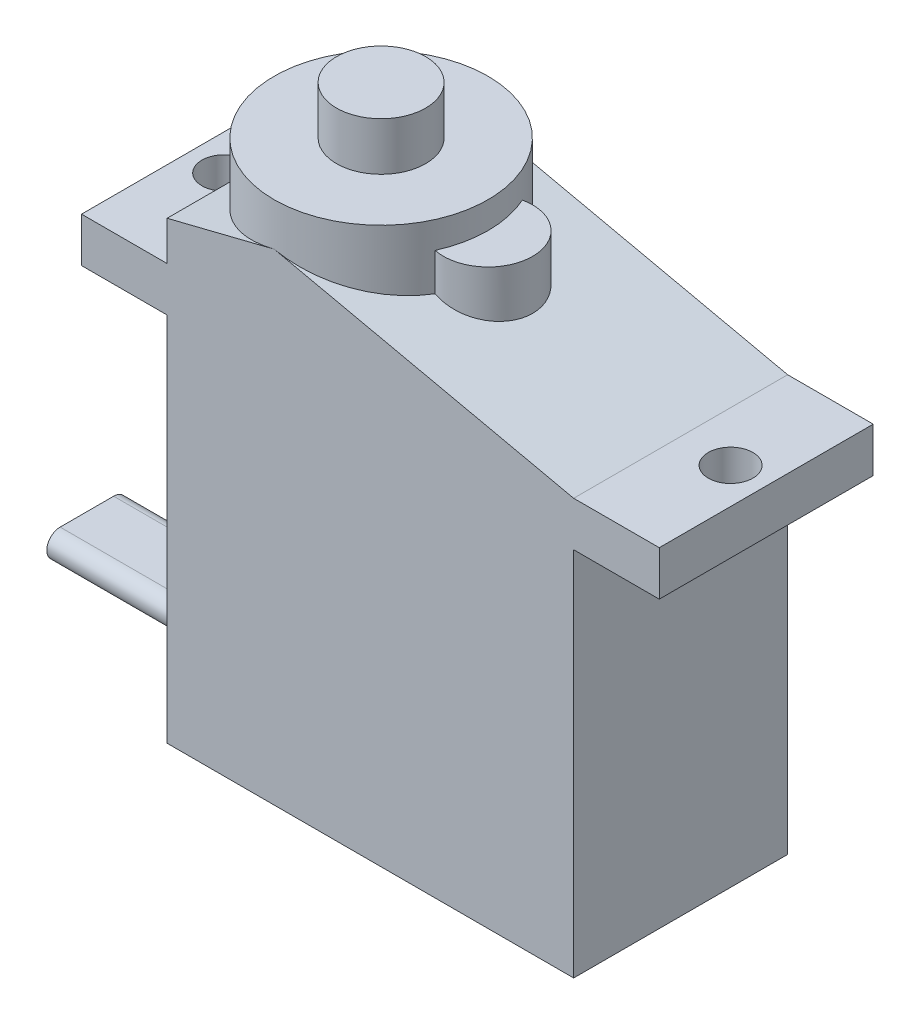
ISO-10303-21;
HEADER;
FILE_DESCRIPTION(('STEP AP214'),'2;1');
FILE_NAME('part.step','',(''),(''),'','','');
FILE_SCHEMA(('AUTOMOTIVE_DESIGN { 1 0 10303 214 1 1 1 1 }'));
ENDSEC;
DATA;
#1=APPLICATION_CONTEXT('core data for automotive mechanical design processes');
#2=APPLICATION_PROTOCOL_DEFINITION('international standard','automotive_design',2000,#1);
#3=PRODUCT_CONTEXT('',#1,'mechanical');
#4=PRODUCT('Part','Part','',(#3));
#5=PRODUCT_RELATED_PRODUCT_CATEGORY('part','',(#4));
#6=PRODUCT_DEFINITION_FORMATION('','',#4);
#7=PRODUCT_DEFINITION_CONTEXT('part definition',#1,'design');
#8=PRODUCT_DEFINITION('design','',#6,#7);
#9=PRODUCT_DEFINITION_SHAPE('','',#8);
#10=(LENGTH_UNIT() NAMED_UNIT(*) SI_UNIT(.MILLI.,.METRE.));
#11=(NAMED_UNIT(*) PLANE_ANGLE_UNIT() SI_UNIT($,.RADIAN.));
#12=(NAMED_UNIT(*) SI_UNIT($,.STERADIAN.) SOLID_ANGLE_UNIT());
#13=UNCERTAINTY_MEASURE_WITH_UNIT(LENGTH_MEASURE(1.E-05),#10,'distance_accuracy_value','');
#14=(GEOMETRIC_REPRESENTATION_CONTEXT(3) GLOBAL_UNCERTAINTY_ASSIGNED_CONTEXT((#13)) GLOBAL_UNIT_ASSIGNED_CONTEXT((#10,
#11,#12)) REPRESENTATION_CONTEXT('',''));
#15=CARTESIAN_POINT('',(0.,0.,0.));
#16=DIRECTION('',(0.,0.,1.));
#17=DIRECTION('',(1.,0.,0.));
#18=AXIS2_PLACEMENT_3D('',#15,#16,#17);
#19=CARTESIAN_POINT('',(6.,32.1,6.));
#20=DIRECTION('',(0.,-1.,0.));
#21=DIRECTION('',(0.,0.,-1.));
#22=AXIS2_PLACEMENT_3D('',#19,#20,#21);
#23=CYLINDRICAL_SURFACE('',#22,2.5);
#24=CARTESIAN_POINT('',(6.,32.1,6.));
#25=DIRECTION('',(0.,1.,0.));
#26=DIRECTION('',(0.,0.,1.));
#27=AXIS2_PLACEMENT_3D('',#24,#25,#26);
#28=CIRCLE('',#27,2.5);
#29=CARTESIAN_POINT('',(6.,32.1,3.5));
#30=VERTEX_POINT('',#29);
#31=EDGE_CURVE('E11',#30,#30,#28,.T.);
#32=CARTESIAN_POINT('',(6.,29.4,6.));
#33=DIRECTION('',(0.,1.,0.));
#34=DIRECTION('',(0.,0.,1.));
#35=AXIS2_PLACEMENT_3D('',#32,#33,#34);
#36=CIRCLE('',#35,2.5);
#37=CARTESIAN_POINT('',(6.,29.4,3.5));
#38=VERTEX_POINT('',#37);
#39=EDGE_CURVE('E53',#38,#38,#36,.T.);
#40=CARTESIAN_POINT('',(6.,32.1,3.5));
#41=CARTESIAN_POINT('',(6.,32.071875,3.5));
#42=CARTESIAN_POINT('',(6.,32.04375,3.5));
#43=CARTESIAN_POINT('',(6.,31.9875,3.5));
#44=CARTESIAN_POINT('',(6.,31.959375,3.5));
#45=CARTESIAN_POINT('',(6.,31.903125,3.5));
#46=CARTESIAN_POINT('',(6.,31.875,3.5));
#47=CARTESIAN_POINT('',(6.,31.81875,3.5));
#48=CARTESIAN_POINT('',(6.,31.790625,3.5));
#49=CARTESIAN_POINT('',(6.,31.734375,3.5));
#50=CARTESIAN_POINT('',(6.,31.70625,3.5));
#51=CARTESIAN_POINT('',(6.,31.65,3.5));
#52=CARTESIAN_POINT('',(6.,31.621875,3.5));
#53=CARTESIAN_POINT('',(6.,31.565625,3.5));
#54=CARTESIAN_POINT('',(6.,31.5375,3.5));
#55=CARTESIAN_POINT('',(6.,31.48125,3.5));
#56=CARTESIAN_POINT('',(6.,31.453125,3.5));
#57=CARTESIAN_POINT('',(6.,31.396875,3.5));
#58=CARTESIAN_POINT('',(6.,31.36875,3.5));
#59=CARTESIAN_POINT('',(6.,31.3125,3.5));
#60=CARTESIAN_POINT('',(6.,31.284375,3.5));
#61=CARTESIAN_POINT('',(6.,31.228125,3.5));
#62=CARTESIAN_POINT('',(6.,31.2,3.5));
#63=CARTESIAN_POINT('',(6.,31.14375,3.5));
#64=CARTESIAN_POINT('',(6.,31.115625,3.5));
#65=CARTESIAN_POINT('',(6.,31.059375,3.5));
#66=CARTESIAN_POINT('',(6.,31.03125,3.5));
#67=CARTESIAN_POINT('',(6.,30.975,3.5));
#68=CARTESIAN_POINT('',(6.,30.946875,3.5));
#69=CARTESIAN_POINT('',(6.,30.890625,3.5));
#70=CARTESIAN_POINT('',(6.,30.8625,3.5));
#71=CARTESIAN_POINT('',(6.,30.80625,3.5));
#72=CARTESIAN_POINT('',(6.,30.778125,3.5));
#73=CARTESIAN_POINT('',(6.,30.721875,3.5));
#74=CARTESIAN_POINT('',(6.,30.69375,3.5));
#75=CARTESIAN_POINT('',(6.,30.6375,3.5));
#76=CARTESIAN_POINT('',(6.,30.609375,3.5));
#77=CARTESIAN_POINT('',(6.,30.553125,3.5));
#78=CARTESIAN_POINT('',(6.,30.525,3.5));
#79=CARTESIAN_POINT('',(6.,30.46875,3.5));
#80=CARTESIAN_POINT('',(6.,30.440625,3.5));
#81=CARTESIAN_POINT('',(6.,30.384375,3.5));
#82=CARTESIAN_POINT('',(6.,30.35625,3.5));
#83=CARTESIAN_POINT('',(6.,30.3,3.5));
#84=CARTESIAN_POINT('',(6.,30.271875,3.5));
#85=CARTESIAN_POINT('',(6.,30.215625,3.5));
#86=CARTESIAN_POINT('',(6.,30.1875,3.5));
#87=CARTESIAN_POINT('',(6.,30.13125,3.5));
#88=CARTESIAN_POINT('',(6.,30.103125,3.5));
#89=CARTESIAN_POINT('',(6.,30.046875,3.5));
#90=CARTESIAN_POINT('',(6.,30.01875,3.5));
#91=CARTESIAN_POINT('',(6.,29.9625,3.5));
#92=CARTESIAN_POINT('',(6.,29.934375,3.5));
#93=CARTESIAN_POINT('',(6.,29.878125,3.5));
#94=CARTESIAN_POINT('',(6.,29.85,3.5));
#95=CARTESIAN_POINT('',(6.,29.79375,3.5));
#96=CARTESIAN_POINT('',(6.,29.765625,3.5));
#97=CARTESIAN_POINT('',(6.,29.709375,3.5));
#98=CARTESIAN_POINT('',(6.,29.68125,3.5));
#99=CARTESIAN_POINT('',(6.,29.625,3.5));
#100=CARTESIAN_POINT('',(6.,29.596875,3.5));
#101=CARTESIAN_POINT('',(6.,29.540625,3.5));
#102=CARTESIAN_POINT('',(6.,29.5125,3.5));
#103=CARTESIAN_POINT('',(6.,29.45625,3.5));
#104=CARTESIAN_POINT('',(6.,29.428125,3.5));
#105=CARTESIAN_POINT('',(6.,29.4,3.5));
#106=B_SPLINE_CURVE_WITH_KNOTS('',3,(#40,#41,#42,#43,#44,#45,#46,#47,#48,#49,#50,#51,#52,#53,
#54,#55,#56,#57,#58,#59,#60,#61,#62,#63,#64,#65,#66,#67,#68,#69,#70,#71,#72,#73,#74,#75,#76,#77,
#78,#79,#80,#81,#82,#83,#84,#85,#86,#87,#88,#89,#90,#91,#92,#93,#94,#95,#96,#97,#98,#99,#100,
#101,#102,#103,#104,#105),.UNSPECIFIED.,.F.,.F.,(4,2,2,2,2,2,2,2,2,2,2,2,2,2,2,2,2,2,2,2,2,2,2,
2,2,2,2,2,2,2,2,2,4),(0.,0.0843750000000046,0.168750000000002,0.253125,0.337500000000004,
0.421875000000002,0.50625,0.590625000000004,0.675000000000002,0.759375,0.843750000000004,
0.928125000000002,1.0125,1.096875,1.18125,1.265625,1.35,1.434375,1.51875,1.603125,1.6875,
1.771875,1.85625,1.940625,2.025,2.109375,2.19375,2.278125,2.3625,2.446875,2.53125,2.615625,2.7),.UNSPECIFIED.);
#107=EDGE_CURVE('BSEAM50',#30,#38,#106,.T.);
#108=ORIENTED_EDGE('',*,*,#31,.F.);
#109=ORIENTED_EDGE('',*,*,#39,.T.);
#110=ORIENTED_EDGE('',*,*,#107,.T.);
#111=ORIENTED_EDGE('',*,*,#107,.F.);
#112=EDGE_LOOP('',(#108,#110,#109,#111));
#113=FACE_BOUND('',#112,.T.);
#114=ADVANCED_FACE('F50',(#113),#23,.T.);
#115=CARTESIAN_POINT('',(6.,32.1,6.));
#116=DIRECTION('',(0.,1.,0.));
#117=DIRECTION('',(0.,0.,1.));
#118=AXIS2_PLACEMENT_3D('',#115,#116,#117);
#119=PLANE('',#118);
#120=ORIENTED_EDGE('',*,*,#31,.T.);
#121=EDGE_LOOP('',(#120));
#122=FACE_BOUND('',#121,.T.);
#123=ADVANCED_FACE('F65',(#122),#119,.T.);
#124=CARTESIAN_POINT('',(6.,29.4,6.));
#125=DIRECTION('',(0.,1.,0.));
#126=DIRECTION('',(0.,0.,1.));
#127=AXIS2_PLACEMENT_3D('',#124,#125,#126);
#128=PLANE('',#127);
#129=ORIENTED_EDGE('',*,*,#39,.F.);
#130=EDGE_LOOP('',(#129));
#131=FACE_BOUND('',#130,.T.);
#132=ADVANCED_FACE('F63',(#131),#128,.F.);
#133=CLOSED_SHELL('',(#114,#123,#132));
#134=MANIFOLD_SOLID_BREP('B2',#133);
#135=CARTESIAN_POINT('',(6.,27.,12.));
#136=DIRECTION('',(-0.215083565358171,-0.976595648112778,0.));
#137=DIRECTION('',(0.976595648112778,-0.215083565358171,0.));
#138=AXIS2_PLACEMENT_3D('',#135,#136,#137);
#139=PLANE('',#138);
#140=CARTESIAN_POINT('',(6.,26.9999999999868,6.));
#141=DIRECTION('',(-0.215083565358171,-0.976595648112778,0.));
#142=DIRECTION('',(-0.976595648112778,0.215083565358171,0.));
#143=AXIS2_PLACEMENT_3D('',#140,#141,#142);
#144=ELLIPSE('',#143,6.14379145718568,6.);
#145=CARTESIAN_POINT('',(6.,27.,0.));
#146=VERTEX_POINT('',#145);
#147=CARTESIAN_POINT('',(11.4791666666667,25.7932787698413,3.55485529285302));
#148=VERTEX_POINT('',#147);
#149=EDGE_CURVE('E258',#146,#148,#144,.T.);
#150=ORIENTED_EDGE('',*,*,#149,.T.);
#151=CARTESIAN_POINT('',(12.,25.6785714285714,6.));
#152=DIRECTION('',(-0.215083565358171,-0.976595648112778,0.));
#153=DIRECTION('',(-0.976595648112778,0.215083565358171,0.));
#154=AXIS2_PLACEMENT_3D('',#151,#152,#153);
#155=ELLIPSE('',#154,2.5599131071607,2.5);
#156=CARTESIAN_POINT('',(11.4791666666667,25.7932787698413,8.44514470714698));
#157=VERTEX_POINT('',#156);
#158=EDGE_CURVE('E243',#157,#148,#155,.F.);
#159=ORIENTED_EDGE('',*,*,#158,.F.);
#160=CARTESIAN_POINT('',(6.,27.0000000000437,12.));
#161=VERTEX_POINT('',#160);
#162=EDGE_CURVE('E267',#157,#161,#144,.T.);
#163=ORIENTED_EDGE('',*,*,#162,.T.);
#164=DIRECTION('',(-0.976595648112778,0.215083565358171,0.));
#165=VECTOR('',#164,1.);
#166=CARTESIAN_POINT('',(6.,27.,12.));
#167=LINE('',#166,#165);
#168=CARTESIAN_POINT('',(22.8,23.3,12.));
#169=VERTEX_POINT('',#168);
#170=EDGE_CURVE('E358',#169,#161,#167,.T.);
#171=ORIENTED_EDGE('',*,*,#170,.F.);
#172=DIRECTION('',(0.,0.,-1.));
#173=VECTOR('',#172,1.);
#174=CARTESIAN_POINT('',(22.8,23.3,12.));
#175=LINE('',#174,#173);
#176=CARTESIAN_POINT('',(22.8,23.3,0.));
#177=VERTEX_POINT('',#176);
#178=EDGE_CURVE('E411',#169,#177,#175,.T.);
#179=ORIENTED_EDGE('',*,*,#178,.T.);
#180=DIRECTION('',(-0.976595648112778,0.215083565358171,0.));
#181=VECTOR('',#180,1.);
#182=CARTESIAN_POINT('',(6.,27.,0.));
#183=LINE('',#182,#181);
#184=EDGE_CURVE('E264',#177,#146,#183,.T.);
#185=ORIENTED_EDGE('',*,*,#184,.T.);
#186=EDGE_LOOP('',(#150,#159,#163,#171,#179,#185));
#187=FACE_BOUND('',#186,.T.);
#188=ADVANCED_FACE('F90',(#187),#139,.F.);
#189=CARTESIAN_POINT('',(0.,25.5,12.));
#190=DIRECTION('',(0.242535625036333,-0.970142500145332,0.));
#191=DIRECTION('',(0.970142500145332,0.242535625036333,0.));
#192=AXIS2_PLACEMENT_3D('',#189,#190,#191);
#193=PLANE('',#192);
#194=CARTESIAN_POINT('',(6.,27.0000000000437,6.));
#195=DIRECTION('',(0.242535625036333,-0.970142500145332,0.));
#196=DIRECTION('',(0.970142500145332,0.242535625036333,0.));
#197=AXIS2_PLACEMENT_3D('',#194,#195,#196);
#198=ELLIPSE('',#197,6.18465843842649,6.);
#199=CARTESIAN_POINT('',(0.,25.5,6.));
#200=VERTEX_POINT('',#199);
#201=EDGE_CURVE('E266',#200,#146,#198,.T.);
#202=ORIENTED_EDGE('',*,*,#201,.T.);
#203=DIRECTION('',(-0.970142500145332,-0.242535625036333,0.));
#204=VECTOR('',#203,1.);
#205=CARTESIAN_POINT('',(0.,25.5,0.));
#206=LINE('',#205,#204);
#207=CARTESIAN_POINT('',(0.,25.5,0.));
#208=VERTEX_POINT('',#207);
#209=EDGE_CURVE('E386',#146,#208,#206,.T.);
#210=ORIENTED_EDGE('',*,*,#209,.T.);
#211=DIRECTION('',(0.,0.,-1.));
#212=VECTOR('',#211,1.);
#213=CARTESIAN_POINT('',(0.,25.5,12.));
#214=LINE('',#213,#212);
#215=EDGE_CURVE('E407',#200,#208,#214,.T.);
#216=ORIENTED_EDGE('',*,*,#215,.F.);
#217=EDGE_LOOP('',(#202,#210,#216));
#218=FACE_BOUND('',#217,.T.);
#219=ADVANCED_FACE('F474',(#218),#193,.F.);
#220=EDGE_CURVE('E114',#161,#200,#198,.T.);
#221=ORIENTED_EDGE('',*,*,#220,.T.);
#222=CARTESIAN_POINT('',(0.,25.5,12.));
#223=VERTEX_POINT('',#222);
#224=EDGE_CURVE('E408',#223,#200,#214,.T.);
#225=ORIENTED_EDGE('',*,*,#224,.F.);
#226=DIRECTION('',(-0.970142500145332,-0.242535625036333,0.));
#227=VECTOR('',#226,1.);
#228=CARTESIAN_POINT('',(0.,25.5,12.));
#229=LINE('',#228,#227);
#230=EDGE_CURVE('E361',#161,#223,#229,.T.);
#231=ORIENTED_EDGE('',*,*,#230,.F.);
#232=EDGE_LOOP('',(#221,#225,#231));
#233=FACE_BOUND('',#232,.T.);
#234=ADVANCED_FACE('F476',(#233),#193,.F.);
#235=CARTESIAN_POINT('',(-0.5,2.25,4.5));
#236=DIRECTION('',(-1.,0.,0.));
#237=DIRECTION('',(0.,0.,1.));
#238=AXIS2_PLACEMENT_3D('',#235,#236,#237);
#239=PLANE('',#238);
#240=CARTESIAN_POINT('',(-0.5,2.25,4.5));
#241=DIRECTION('',(-1.,0.,0.));
#242=DIRECTION('',(0.,0.,1.));
#243=AXIS2_PLACEMENT_3D('',#240,#241,#242);
#244=CIRCLE('',#243,1.25);
#245=CARTESIAN_POINT('',(-0.5,3.5,4.5));
#246=VERTEX_POINT('',#245);
#247=CARTESIAN_POINT('',(-0.5,0.999999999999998,4.5));
#248=VERTEX_POINT('',#247);
#249=EDGE_CURVE('E303',#246,#248,#244,.T.);
#250=ORIENTED_EDGE('',*,*,#249,.T.);
#251=DIRECTION('',(0.,0.,1.));
#252=VECTOR('',#251,1.);
#253=CARTESIAN_POINT('',(-0.5,0.999999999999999,7.5));
#254=LINE('',#253,#252);
#255=CARTESIAN_POINT('',(-0.5,0.999999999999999,7.5));
#256=VERTEX_POINT('',#255);
#257=EDGE_CURVE('E306',#248,#256,#254,.T.);
#258=ORIENTED_EDGE('',*,*,#257,.T.);
#259=CARTESIAN_POINT('',(-0.5,2.25,7.5));
#260=DIRECTION('',(-1.,0.,0.));
#261=DIRECTION('',(0.,0.,-1.));
#262=AXIS2_PLACEMENT_3D('',#259,#260,#261);
#263=CIRCLE('',#262,1.25);
#264=CARTESIAN_POINT('',(-0.5,3.5,7.5));
#265=VERTEX_POINT('',#264);
#266=EDGE_CURVE('E309',#256,#265,#263,.T.);
#267=ORIENTED_EDGE('',*,*,#266,.T.);
#268=DIRECTION('',(0.,0.,-1.));
#269=VECTOR('',#268,1.);
#270=CARTESIAN_POINT('',(-0.5,3.5,4.5));
#271=LINE('',#270,#269);
#272=EDGE_CURVE('E311',#265,#246,#271,.T.);
#273=ORIENTED_EDGE('',*,*,#272,.T.);
#274=EDGE_LOOP('',(#250,#258,#267,#273));
#275=FACE_BOUND('',#274,.T.);
#276=DIRECTION('',(0.,0.,1.));
#277=VECTOR('',#276,1.);
#278=CARTESIAN_POINT('',(-0.5,1.5,4.5));
#279=LINE('',#278,#277);
#280=CARTESIAN_POINT('',(-0.5,1.5,4.5));
#281=VERTEX_POINT('',#280);
#282=CARTESIAN_POINT('',(-0.5,1.5,7.5));
#283=VERTEX_POINT('',#282);
#284=EDGE_CURVE('E287',#281,#283,#279,.T.);
#285=ORIENTED_EDGE('',*,*,#284,.F.);
#286=CARTESIAN_POINT('',(-0.5,2.25,4.5));
#287=DIRECTION('',(-1.,0.,0.));
#288=DIRECTION('',(0.,0.,1.));
#289=AXIS2_PLACEMENT_3D('',#286,#287,#288);
#290=CIRCLE('',#289,0.75);
#291=CARTESIAN_POINT('',(-0.5,3.,4.5));
#292=VERTEX_POINT('',#291);
#293=EDGE_CURVE('E284',#292,#281,#290,.T.);
#294=ORIENTED_EDGE('',*,*,#293,.F.);
#295=DIRECTION('',(0.,0.,-1.));
#296=VECTOR('',#295,1.);
#297=CARTESIAN_POINT('',(-0.5,3.,7.5));
#298=LINE('',#297,#296);
#299=CARTESIAN_POINT('',(-0.5,3.,7.5));
#300=VERTEX_POINT('',#299);
#301=EDGE_CURVE('E277',#300,#292,#298,.T.);
#302=ORIENTED_EDGE('',*,*,#301,.F.);
#303=CARTESIAN_POINT('',(-0.5,2.25,7.5));
#304=DIRECTION('',(-1.,0.,0.));
#305=DIRECTION('',(0.,0.,1.));
#306=AXIS2_PLACEMENT_3D('',#303,#304,#305);
#307=CIRCLE('',#306,0.75);
#308=EDGE_CURVE('E289',#283,#300,#307,.T.);
#309=ORIENTED_EDGE('',*,*,#308,.F.);
#310=EDGE_LOOP('',(#285,#294,#302,#309));
#311=FACE_BOUND('',#310,.T.);
#312=ADVANCED_FACE('F478',(#275,#311),#239,.T.);
#313=CARTESIAN_POINT('',(0.,0.,12.));
#314=DIRECTION('',(1.,0.,0.));
#315=DIRECTION('',(0.,0.,-1.));
#316=AXIS2_PLACEMENT_3D('',#313,#314,#315);
#317=PLANE('',#316);
#318=DIRECTION('',(0.,-1.,0.));
#319=VECTOR('',#318,1.);
#320=CARTESIAN_POINT('',(0.,0.,0.));
#321=LINE('',#320,#319);
#322=CARTESIAN_POINT('',(0.,20.8,0.));
#323=VERTEX_POINT('',#322);
#324=CARTESIAN_POINT('',(0.,0.,0.));
#325=VERTEX_POINT('',#324);
#326=EDGE_CURVE('E372',#323,#325,#321,.T.);
#327=ORIENTED_EDGE('',*,*,#326,.T.);
#328=DIRECTION('',(0.,0.,-1.));
#329=VECTOR('',#328,1.);
#330=CARTESIAN_POINT('',(0.,0.,12.));
#331=LINE('',#330,#329);
#332=CARTESIAN_POINT('',(0.,0.,12.));
#333=VERTEX_POINT('',#332);
#334=EDGE_CURVE('E48',#333,#325,#331,.T.);
#335=ORIENTED_EDGE('',*,*,#334,.F.);
#336=DIRECTION('',(0.,-1.,0.));
#337=VECTOR('',#336,1.);
#338=CARTESIAN_POINT('',(0.,0.,12.));
#339=LINE('',#338,#337);
#340=CARTESIAN_POINT('',(0.,20.8,12.));
#341=VERTEX_POINT('',#340);
#342=EDGE_CURVE('E344',#341,#333,#339,.T.);
#343=ORIENTED_EDGE('',*,*,#342,.F.);
#344=DIRECTION('',(0.,0.,-1.));
#345=VECTOR('',#344,1.);
#346=CARTESIAN_POINT('',(0.,20.8,12.));
#347=LINE('',#346,#345);
#348=EDGE_CURVE('E371',#341,#323,#347,.T.);
#349=ORIENTED_EDGE('',*,*,#348,.T.);
#350=EDGE_LOOP('',(#327,#335,#343,#349));
#351=FACE_BOUND('',#350,.T.);
#352=CARTESIAN_POINT('',(0.,2.25,4.5));
#353=DIRECTION('',(-1.,0.,0.));
#354=DIRECTION('',(0.,0.,1.));
#355=AXIS2_PLACEMENT_3D('',#352,#353,#354);
#356=CIRCLE('',#355,1.25);
#357=CARTESIAN_POINT('',(0.,3.5,4.5));
#358=VERTEX_POINT('',#357);
#359=CARTESIAN_POINT('',(0.,0.999999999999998,4.5));
#360=VERTEX_POINT('',#359);
#361=EDGE_CURVE('E302',#358,#360,#356,.T.);
#362=ORIENTED_EDGE('',*,*,#361,.F.);
#363=DIRECTION('',(0.,0.,-1.));
#364=VECTOR('',#363,1.);
#365=CARTESIAN_POINT('',(0.,3.5,4.5));
#366=LINE('',#365,#364);
#367=CARTESIAN_POINT('',(0.,3.5,7.5));
#368=VERTEX_POINT('',#367);
#369=EDGE_CURVE('E307',#368,#358,#366,.T.);
#370=ORIENTED_EDGE('',*,*,#369,.F.);
#371=CARTESIAN_POINT('',(0.,2.25,7.5));
#372=DIRECTION('',(-1.,0.,0.));
#373=DIRECTION('',(0.,0.,-1.));
#374=AXIS2_PLACEMENT_3D('',#371,#372,#373);
#375=CIRCLE('',#374,1.25);
#376=CARTESIAN_POINT('',(0.,0.999999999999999,7.5));
#377=VERTEX_POINT('',#376);
#378=EDGE_CURVE('E319',#377,#368,#375,.T.);
#379=ORIENTED_EDGE('',*,*,#378,.F.);
#380=DIRECTION('',(0.,0.,1.));
#381=VECTOR('',#380,1.);
#382=CARTESIAN_POINT('',(0.,0.999999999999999,7.5));
#383=LINE('',#382,#381);
#384=EDGE_CURVE('E316',#360,#377,#383,.T.);
#385=ORIENTED_EDGE('',*,*,#384,.F.);
#386=EDGE_LOOP('',(#362,#370,#379,#385));
#387=FACE_BOUND('',#386,.T.);
#388=ADVANCED_FACE('F92',(#351,#387),#317,.F.);
#389=CARTESIAN_POINT('',(0.,0.,12.));
#390=DIRECTION('',(0.,1.,0.));
#391=DIRECTION('',(0.,0.,1.));
#392=AXIS2_PLACEMENT_3D('',#389,#390,#391);
#393=PLANE('',#392);
#394=DIRECTION('',(1.,0.,0.));
#395=VECTOR('',#394,1.);
#396=CARTESIAN_POINT('',(0.,0.,0.));
#397=LINE('',#396,#395);
#398=CARTESIAN_POINT('',(22.8,0.,0.));
#399=VERTEX_POINT('',#398);
#400=EDGE_CURVE('E375',#325,#399,#397,.T.);
#401=ORIENTED_EDGE('',*,*,#400,.T.);
#402=DIRECTION('',(0.,0.,-1.));
#403=VECTOR('',#402,1.);
#404=CARTESIAN_POINT('',(22.8,0.,12.));
#405=LINE('',#404,#403);
#406=CARTESIAN_POINT('',(22.8,0.,12.));
#407=VERTEX_POINT('',#406);
#408=EDGE_CURVE('E99',#407,#399,#405,.T.);
#409=ORIENTED_EDGE('',*,*,#408,.F.);
#410=DIRECTION('',(1.,0.,0.));
#411=VECTOR('',#410,1.);
#412=CARTESIAN_POINT('',(0.,0.,12.));
#413=LINE('',#412,#411);
#414=EDGE_CURVE('E347',#333,#407,#413,.T.);
#415=ORIENTED_EDGE('',*,*,#414,.F.);
#416=ORIENTED_EDGE('',*,*,#334,.T.);
#417=EDGE_LOOP('',(#401,#409,#415,#416));
#418=FACE_BOUND('',#417,.T.);
#419=ADVANCED_FACE('F450',(#418),#393,.F.);
#420=CARTESIAN_POINT('',(22.8,0.,12.));
#421=DIRECTION('',(-1.,0.,0.));
#422=DIRECTION('',(0.,0.,1.));
#423=AXIS2_PLACEMENT_3D('',#420,#421,#422);
#424=PLANE('',#423);
#425=DIRECTION('',(0.,1.,0.));
#426=VECTOR('',#425,1.);
#427=CARTESIAN_POINT('',(22.8,0.,0.));
#428=LINE('',#427,#426);
#429=CARTESIAN_POINT('',(22.8,20.8,0.));
#430=VERTEX_POINT('',#429);
#431=EDGE_CURVE('E377',#399,#430,#428,.T.);
#432=ORIENTED_EDGE('',*,*,#431,.T.);
#433=DIRECTION('',(0.,0.,-1.));
#434=VECTOR('',#433,1.);
#435=CARTESIAN_POINT('',(22.8,20.8,12.));
#436=LINE('',#435,#434);
#437=CARTESIAN_POINT('',(22.8,20.8,12.));
#438=VERTEX_POINT('',#437);
#439=EDGE_CURVE('E419',#438,#430,#436,.T.);
#440=ORIENTED_EDGE('',*,*,#439,.F.);
#441=DIRECTION('',(0.,1.,0.));
#442=VECTOR('',#441,1.);
#443=CARTESIAN_POINT('',(22.8,0.,12.));
#444=LINE('',#443,#442);
#445=EDGE_CURVE('E350',#407,#438,#444,.T.);
#446=ORIENTED_EDGE('',*,*,#445,.F.);
#447=ORIENTED_EDGE('',*,*,#408,.T.);
#448=EDGE_LOOP('',(#432,#440,#446,#447));
#449=FACE_BOUND('',#448,.T.);
#450=ADVANCED_FACE('F427',(#449),#424,.F.);
#451=CARTESIAN_POINT('',(22.8,20.8,12.));
#452=DIRECTION('',(0.,1.,0.));
#453=DIRECTION('',(0.,0.,1.));
#454=AXIS2_PLACEMENT_3D('',#451,#452,#453);
#455=PLANE('',#454);
#456=CARTESIAN_POINT('',(25.6,20.8,6.));
#457=DIRECTION('',(0.,1.,0.));
#458=DIRECTION('',(0.,0.,1.));
#459=AXIS2_PLACEMENT_3D('',#456,#457,#458);
#460=CIRCLE('',#459,1.25);
#461=CARTESIAN_POINT('',(25.6,20.8,7.25));
#462=VERTEX_POINT('',#461);
#463=EDGE_CURVE('E338',#462,#462,#460,.T.);
#464=ORIENTED_EDGE('',*,*,#463,.T.);
#465=EDGE_LOOP('',(#464));
#466=FACE_BOUND('',#465,.T.);
#467=DIRECTION('',(1.,0.,0.));
#468=VECTOR('',#467,1.);
#469=CARTESIAN_POINT('',(22.8,20.8,0.));
#470=LINE('',#469,#468);
#471=CARTESIAN_POINT('',(27.6,20.8,0.));
#472=VERTEX_POINT('',#471);
#473=EDGE_CURVE('E379',#430,#472,#470,.T.);
#474=ORIENTED_EDGE('',*,*,#473,.T.);
#475=DIRECTION('',(0.,0.,-1.));
#476=VECTOR('',#475,1.);
#477=CARTESIAN_POINT('',(27.6,20.8,12.));
#478=LINE('',#477,#476);
#479=CARTESIAN_POINT('',(27.6,20.8,12.));
#480=VERTEX_POINT('',#479);
#481=EDGE_CURVE('E416',#480,#472,#478,.T.);
#482=ORIENTED_EDGE('',*,*,#481,.F.);
#483=DIRECTION('',(1.,0.,0.));
#484=VECTOR('',#483,1.);
#485=CARTESIAN_POINT('',(22.8,20.8,12.));
#486=LINE('',#485,#484);
#487=EDGE_CURVE('E352',#438,#480,#486,.T.);
#488=ORIENTED_EDGE('',*,*,#487,.F.);
#489=ORIENTED_EDGE('',*,*,#439,.T.);
#490=EDGE_LOOP('',(#474,#482,#488,#489));
#491=FACE_BOUND('',#490,.T.);
#492=ADVANCED_FACE('F438',(#466,#491),#455,.F.);
#493=CARTESIAN_POINT('',(27.6,20.8,12.));
#494=DIRECTION('',(-1.,0.,0.));
#495=DIRECTION('',(0.,0.,1.));
#496=AXIS2_PLACEMENT_3D('',#493,#494,#495);
#497=PLANE('',#496);
#498=DIRECTION('',(0.,1.,0.));
#499=VECTOR('',#498,1.);
#500=CARTESIAN_POINT('',(27.6,20.8,0.));
#501=LINE('',#500,#499);
#502=CARTESIAN_POINT('',(27.6,23.3,0.));
#503=VERTEX_POINT('',#502);
#504=EDGE_CURVE('E381',#472,#503,#501,.T.);
#505=ORIENTED_EDGE('',*,*,#504,.T.);
#506=DIRECTION('',(0.,0.,-1.));
#507=VECTOR('',#506,1.);
#508=CARTESIAN_POINT('',(27.6,23.3,12.));
#509=LINE('',#508,#507);
#510=CARTESIAN_POINT('',(27.6,23.3,12.));
#511=VERTEX_POINT('',#510);
#512=EDGE_CURVE('E413',#511,#503,#509,.T.);
#513=ORIENTED_EDGE('',*,*,#512,.F.);
#514=DIRECTION('',(0.,1.,0.));
#515=VECTOR('',#514,1.);
#516=CARTESIAN_POINT('',(27.6,20.8,12.));
#517=LINE('',#516,#515);
#518=EDGE_CURVE('E354',#480,#511,#517,.T.);
#519=ORIENTED_EDGE('',*,*,#518,.F.);
#520=ORIENTED_EDGE('',*,*,#481,.T.);
#521=EDGE_LOOP('',(#505,#513,#519,#520));
#522=FACE_BOUND('',#521,.T.);
#523=ADVANCED_FACE('F442',(#522),#497,.F.);
#524=CARTESIAN_POINT('',(27.6,23.3,12.));
#525=DIRECTION('',(0.,-1.,0.));
#526=DIRECTION('',(0.,0.,-1.));
#527=AXIS2_PLACEMENT_3D('',#524,#525,#526);
#528=PLANE('',#527);
#529=CARTESIAN_POINT('',(25.6,23.3,6.));
#530=DIRECTION('',(0.,1.,0.));
#531=DIRECTION('',(0.,0.,1.));
#532=AXIS2_PLACEMENT_3D('',#529,#530,#531);
#533=CIRCLE('',#532,1.25);
#534=CARTESIAN_POINT('',(25.6,23.3,7.25));
#535=VERTEX_POINT('',#534);
#536=EDGE_CURVE('E335',#535,#535,#533,.T.);
#537=ORIENTED_EDGE('',*,*,#536,.F.);
#538=EDGE_LOOP('',(#537));
#539=FACE_BOUND('',#538,.T.);
#540=DIRECTION('',(-1.,0.,0.));
#541=VECTOR('',#540,1.);
#542=CARTESIAN_POINT('',(27.6,23.3,0.));
#543=LINE('',#542,#541);
#544=EDGE_CURVE('E383',#503,#177,#543,.T.);
#545=ORIENTED_EDGE('',*,*,#544,.T.);
#546=ORIENTED_EDGE('',*,*,#178,.F.);
#547=DIRECTION('',(-1.,0.,0.));
#548=VECTOR('',#547,1.);
#549=CARTESIAN_POINT('',(27.6,23.3,12.));
#550=LINE('',#549,#548);
#551=EDGE_CURVE('E356',#511,#169,#550,.T.);
#552=ORIENTED_EDGE('',*,*,#551,.F.);
#553=ORIENTED_EDGE('',*,*,#512,.T.);
#554=EDGE_LOOP('',(#545,#546,#552,#553));
#555=FACE_BOUND('',#554,.T.);
#556=ADVANCED_FACE('F492',(#539,#555),#528,.F.);
#557=CARTESIAN_POINT('',(0.,23.3,12.));
#558=DIRECTION('',(1.,0.,0.));
#559=DIRECTION('',(0.,1.,0.));
#560=AXIS2_PLACEMENT_3D('',#557,#558,#559);
#561=PLANE('',#560);
#562=DIRECTION('',(0.,-1.,0.));
#563=VECTOR('',#562,1.);
#564=CARTESIAN_POINT('',(0.,23.3,0.));
#565=LINE('',#564,#563);
#566=CARTESIAN_POINT('',(0.,23.3,0.));
#567=VERTEX_POINT('',#566);
#568=EDGE_CURVE('E389',#208,#567,#565,.T.);
#569=ORIENTED_EDGE('',*,*,#568,.T.);
#570=DIRECTION('',(0.,0.,-1.));
#571=VECTOR('',#570,1.);
#572=CARTESIAN_POINT('',(0.,23.3,12.));
#573=LINE('',#572,#571);
#574=CARTESIAN_POINT('',(0.,23.3,12.));
#575=VERTEX_POINT('',#574);
#576=EDGE_CURVE('E404',#575,#567,#573,.T.);
#577=ORIENTED_EDGE('',*,*,#576,.F.);
#578=DIRECTION('',(0.,-1.,0.));
#579=VECTOR('',#578,1.);
#580=CARTESIAN_POINT('',(0.,23.3,12.));
#581=LINE('',#580,#579);
#582=EDGE_CURVE('E363',#223,#575,#581,.T.);
#583=ORIENTED_EDGE('',*,*,#582,.F.);
#584=ORIENTED_EDGE('',*,*,#224,.T.);
#585=ORIENTED_EDGE('',*,*,#215,.T.);
#586=EDGE_LOOP('',(#569,#577,#583,#584,#585));
#587=FACE_BOUND('',#586,.T.);
#588=ADVANCED_FACE('F471',(#587),#561,.F.);
#589=CARTESIAN_POINT('',(0.,23.3,12.));
#590=DIRECTION('',(0.,-1.,0.));
#591=DIRECTION('',(0.,0.,-1.));
#592=AXIS2_PLACEMENT_3D('',#589,#590,#591);
#593=PLANE('',#592);
#594=CARTESIAN_POINT('',(-2.8,23.3,6.));
#595=DIRECTION('',(0.,1.,0.));
#596=DIRECTION('',(0.,0.,1.));
#597=AXIS2_PLACEMENT_3D('',#594,#595,#596);
#598=CIRCLE('',#597,1.25);
#599=CARTESIAN_POINT('',(-2.8,23.3,7.25));
#600=VERTEX_POINT('',#599);
#601=EDGE_CURVE('E341',#600,#600,#598,.T.);
#602=ORIENTED_EDGE('',*,*,#601,.F.);
#603=EDGE_LOOP('',(#602));
#604=FACE_BOUND('',#603,.T.);
#605=DIRECTION('',(-1.,0.,0.));
#606=VECTOR('',#605,1.);
#607=CARTESIAN_POINT('',(0.,23.3,0.));
#608=LINE('',#607,#606);
#609=CARTESIAN_POINT('',(-4.8,23.3,0.));
#610=VERTEX_POINT('',#609);
#611=EDGE_CURVE('E391',#567,#610,#608,.T.);
#612=ORIENTED_EDGE('',*,*,#611,.T.);
#613=DIRECTION('',(0.,0.,-1.));
#614=VECTOR('',#613,1.);
#615=CARTESIAN_POINT('',(-4.8,23.3,12.));
#616=LINE('',#615,#614);
#617=CARTESIAN_POINT('',(-4.8,23.3,12.));
#618=VERTEX_POINT('',#617);
#619=EDGE_CURVE('E401',#618,#610,#616,.T.);
#620=ORIENTED_EDGE('',*,*,#619,.F.);
#621=DIRECTION('',(-1.,0.,0.));
#622=VECTOR('',#621,1.);
#623=CARTESIAN_POINT('',(0.,23.3,12.));
#624=LINE('',#623,#622);
#625=EDGE_CURVE('E365',#575,#618,#624,.T.);
#626=ORIENTED_EDGE('',*,*,#625,.F.);
#627=ORIENTED_EDGE('',*,*,#576,.T.);
#628=EDGE_LOOP('',(#612,#620,#626,#627));
#629=FACE_BOUND('',#628,.T.);
#630=ADVANCED_FACE('F467',(#604,#629),#593,.F.);
#631=CARTESIAN_POINT('',(-4.8,20.8,12.));
#632=DIRECTION('',(1.,0.,0.));
#633=DIRECTION('',(0.,0.,-1.));
#634=AXIS2_PLACEMENT_3D('',#631,#632,#633);
#635=PLANE('',#634);
#636=DIRECTION('',(0.,-1.,0.));
#637=VECTOR('',#636,1.);
#638=CARTESIAN_POINT('',(-4.8,20.8,0.));
#639=LINE('',#638,#637);
#640=CARTESIAN_POINT('',(-4.8,20.8,0.));
#641=VERTEX_POINT('',#640);
#642=EDGE_CURVE('E393',#610,#641,#639,.T.);
#643=ORIENTED_EDGE('',*,*,#642,.T.);
#644=DIRECTION('',(0.,0.,-1.));
#645=VECTOR('',#644,1.);
#646=CARTESIAN_POINT('',(-4.8,20.8,12.));
#647=LINE('',#646,#645);
#648=CARTESIAN_POINT('',(-4.8,20.8,12.));
#649=VERTEX_POINT('',#648);
#650=EDGE_CURVE('E398',#649,#641,#647,.T.);
#651=ORIENTED_EDGE('',*,*,#650,.F.);
#652=DIRECTION('',(0.,-1.,0.));
#653=VECTOR('',#652,1.);
#654=CARTESIAN_POINT('',(-4.8,20.8,12.));
#655=LINE('',#654,#653);
#656=EDGE_CURVE('E367',#618,#649,#655,.T.);
#657=ORIENTED_EDGE('',*,*,#656,.F.);
#658=ORIENTED_EDGE('',*,*,#619,.T.);
#659=EDGE_LOOP('',(#643,#651,#657,#658));
#660=FACE_BOUND('',#659,.T.);
#661=ADVANCED_FACE('F463',(#660),#635,.F.);
#662=CARTESIAN_POINT('',(-4.8,20.8,12.));
#663=DIRECTION('',(0.,1.,0.));
#664=DIRECTION('',(0.,0.,1.));
#665=AXIS2_PLACEMENT_3D('',#662,#663,#664);
#666=PLANE('',#665);
#667=CARTESIAN_POINT('',(-2.8,20.8,6.));
#668=DIRECTION('',(0.,1.,0.));
#669=DIRECTION('',(0.,0.,1.));
#670=AXIS2_PLACEMENT_3D('',#667,#668,#669);
#671=CIRCLE('',#670,1.25);
#672=CARTESIAN_POINT('',(-2.8,20.8,7.25));
#673=VERTEX_POINT('',#672);
#674=EDGE_CURVE('E94',#673,#673,#671,.T.);
#675=ORIENTED_EDGE('',*,*,#674,.T.);
#676=EDGE_LOOP('',(#675));
#677=FACE_BOUND('',#676,.T.);
#678=DIRECTION('',(1.,0.,0.));
#679=VECTOR('',#678,1.);
#680=CARTESIAN_POINT('',(-4.8,20.8,0.));
#681=LINE('',#680,#679);
#682=EDGE_CURVE('E348',#641,#323,#681,.T.);
#683=ORIENTED_EDGE('',*,*,#682,.T.);
#684=ORIENTED_EDGE('',*,*,#348,.F.);
#685=DIRECTION('',(1.,0.,0.));
#686=VECTOR('',#685,1.);
#687=CARTESIAN_POINT('',(-4.8,20.8,12.));
#688=LINE('',#687,#686);
#689=EDGE_CURVE('E369',#649,#341,#688,.T.);
#690=ORIENTED_EDGE('',*,*,#689,.F.);
#691=ORIENTED_EDGE('',*,*,#650,.T.);
#692=EDGE_LOOP('',(#683,#684,#690,#691));
#693=FACE_BOUND('',#692,.T.);
#694=ADVANCED_FACE('F458',(#677,#693),#666,.F.);
#695=CARTESIAN_POINT('',(0.,20.8,12.));
#696=DIRECTION('',(0.,0.,-1.));
#697=DIRECTION('',(-1.,0.,0.));
#698=AXIS2_PLACEMENT_3D('',#695,#696,#697);
#699=PLANE('',#698);
#700=ORIENTED_EDGE('',*,*,#342,.T.);
#701=ORIENTED_EDGE('',*,*,#414,.T.);
#702=ORIENTED_EDGE('',*,*,#445,.T.);
#703=ORIENTED_EDGE('',*,*,#487,.T.);
#704=ORIENTED_EDGE('',*,*,#518,.T.);
#705=ORIENTED_EDGE('',*,*,#551,.T.);
#706=ORIENTED_EDGE('',*,*,#170,.T.);
#707=ORIENTED_EDGE('',*,*,#230,.T.);
#708=ORIENTED_EDGE('',*,*,#582,.T.);
#709=ORIENTED_EDGE('',*,*,#625,.T.);
#710=ORIENTED_EDGE('',*,*,#656,.T.);
#711=ORIENTED_EDGE('',*,*,#689,.T.);
#712=EDGE_LOOP('',(#700,#701,#702,#703,#704,#705,#706,#707,#708,#709,#710,#711));
#713=FACE_BOUND('',#712,.T.);
#714=ADVANCED_FACE('F446',(#713),#699,.F.);
#715=CARTESIAN_POINT('',(0.,20.8,0.));
#716=DIRECTION('',(0.,0.,-1.));
#717=DIRECTION('',(-1.,0.,0.));
#718=AXIS2_PLACEMENT_3D('',#715,#716,#717);
#719=PLANE('',#718);
#720=ORIENTED_EDGE('',*,*,#326,.F.);
#721=ORIENTED_EDGE('',*,*,#682,.F.);
#722=ORIENTED_EDGE('',*,*,#642,.F.);
#723=ORIENTED_EDGE('',*,*,#611,.F.);
#724=ORIENTED_EDGE('',*,*,#568,.F.);
#725=ORIENTED_EDGE('',*,*,#209,.F.);
#726=ORIENTED_EDGE('',*,*,#184,.F.);
#727=ORIENTED_EDGE('',*,*,#544,.F.);
#728=ORIENTED_EDGE('',*,*,#504,.F.);
#729=ORIENTED_EDGE('',*,*,#473,.F.);
#730=ORIENTED_EDGE('',*,*,#431,.F.);
#731=ORIENTED_EDGE('',*,*,#400,.F.);
#732=EDGE_LOOP('',(#720,#721,#722,#723,#724,#725,#726,#727,#728,#729,#730,#731));
#733=FACE_BOUND('',#732,.T.);
#734=ADVANCED_FACE('F433',(#733),#719,.T.);
#735=CARTESIAN_POINT('',(-2.8,0.,6.));
#736=DIRECTION('',(0.,1.,0.));
#737=DIRECTION('',(0.,0.,1.));
#738=AXIS2_PLACEMENT_3D('',#735,#736,#737);
#739=CYLINDRICAL_SURFACE('',#738,1.25);
#740=ORIENTED_EDGE('',*,*,#601,.T.);
#741=EDGE_LOOP('',(#740));
#742=FACE_BOUND('',#741,.T.);
#743=ORIENTED_EDGE('',*,*,#674,.F.);
#744=EDGE_LOOP('',(#743));
#745=FACE_BOUND('',#744,.T.);
#746=ADVANCED_FACE('F601',(#742,#745),#739,.F.);
#747=CARTESIAN_POINT('',(25.6,0.,6.));
#748=DIRECTION('',(0.,1.,0.));
#749=DIRECTION('',(0.,0.,1.));
#750=AXIS2_PLACEMENT_3D('',#747,#748,#749);
#751=CYLINDRICAL_SURFACE('',#750,1.25);
#752=ORIENTED_EDGE('',*,*,#536,.T.);
#753=EDGE_LOOP('',(#752));
#754=FACE_BOUND('',#753,.T.);
#755=ORIENTED_EDGE('',*,*,#463,.F.);
#756=EDGE_LOOP('',(#755));
#757=FACE_BOUND('',#756,.T.);
#758=ADVANCED_FACE('F662',(#754,#757),#751,.F.);
#759=CARTESIAN_POINT('',(-0.5,2.25,4.5));
#760=DIRECTION('',(1.,0.,0.));
#761=DIRECTION('',(0.,0.,-1.));
#762=AXIS2_PLACEMENT_3D('',#759,#760,#761);
#763=CYLINDRICAL_SURFACE('',#762,1.25);
#764=ORIENTED_EDGE('',*,*,#361,.T.);
#765=DIRECTION('',(1.,0.,0.));
#766=VECTOR('',#765,1.);
#767=CARTESIAN_POINT('',(-0.5,0.999999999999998,4.5));
#768=LINE('',#767,#766);
#769=EDGE_CURVE('E332',#248,#360,#768,.T.);
#770=ORIENTED_EDGE('',*,*,#769,.F.);
#771=ORIENTED_EDGE('',*,*,#249,.F.);
#772=DIRECTION('',(1.,0.,0.));
#773=VECTOR('',#772,1.);
#774=CARTESIAN_POINT('',(-0.5,3.5,4.5));
#775=LINE('',#774,#773);
#776=EDGE_CURVE('E313',#246,#358,#775,.T.);
#777=ORIENTED_EDGE('',*,*,#776,.T.);
#778=EDGE_LOOP('',(#764,#770,#771,#777));
#779=FACE_BOUND('',#778,.T.);
#780=ADVANCED_FACE('F658',(#779),#763,.T.);
#781=CARTESIAN_POINT('',(-0.5,0.999999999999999,7.5));
#782=DIRECTION('',(0.,1.,0.));
#783=DIRECTION('',(0.,0.,1.));
#784=AXIS2_PLACEMENT_3D('',#781,#782,#783);
#785=PLANE('',#784);
#786=ORIENTED_EDGE('',*,*,#384,.T.);
#787=DIRECTION('',(1.,0.,0.));
#788=VECTOR('',#787,1.);
#789=CARTESIAN_POINT('',(-0.5,0.999999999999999,7.5));
#790=LINE('',#789,#788);
#791=EDGE_CURVE('E329',#256,#377,#790,.T.);
#792=ORIENTED_EDGE('',*,*,#791,.F.);
#793=ORIENTED_EDGE('',*,*,#257,.F.);
#794=ORIENTED_EDGE('',*,*,#769,.T.);
#795=EDGE_LOOP('',(#786,#792,#793,#794));
#796=FACE_BOUND('',#795,.T.);
#797=ADVANCED_FACE('F654',(#796),#785,.F.);
#798=CARTESIAN_POINT('',(-0.5,2.25,7.5));
#799=DIRECTION('',(1.,0.,0.));
#800=DIRECTION('',(0.,0.,-1.));
#801=AXIS2_PLACEMENT_3D('',#798,#799,#800);
#802=CYLINDRICAL_SURFACE('',#801,1.25);
#803=ORIENTED_EDGE('',*,*,#378,.T.);
#804=DIRECTION('',(1.,0.,0.));
#805=VECTOR('',#804,1.);
#806=CARTESIAN_POINT('',(-0.5,3.5,7.5));
#807=LINE('',#806,#805);
#808=EDGE_CURVE('E326',#265,#368,#807,.T.);
#809=ORIENTED_EDGE('',*,*,#808,.F.);
#810=ORIENTED_EDGE('',*,*,#266,.F.);
#811=ORIENTED_EDGE('',*,*,#791,.T.);
#812=EDGE_LOOP('',(#803,#809,#810,#811));
#813=FACE_BOUND('',#812,.T.);
#814=ADVANCED_FACE('F650',(#813),#802,.T.);
#815=CARTESIAN_POINT('',(-0.5,3.5,4.5));
#816=DIRECTION('',(0.,-1.,0.));
#817=DIRECTION('',(0.,0.,-1.));
#818=AXIS2_PLACEMENT_3D('',#815,#816,#817);
#819=PLANE('',#818);
#820=ORIENTED_EDGE('',*,*,#369,.T.);
#821=ORIENTED_EDGE('',*,*,#776,.F.);
#822=ORIENTED_EDGE('',*,*,#272,.F.);
#823=ORIENTED_EDGE('',*,*,#808,.T.);
#824=EDGE_LOOP('',(#820,#821,#822,#823));
#825=FACE_BOUND('',#824,.T.);
#826=ADVANCED_FACE('F522',(#825),#819,.F.);
#827=CARTESIAN_POINT('',(-10.5,2.25,4.5));
#828=DIRECTION('',(1.,0.,0.));
#829=DIRECTION('',(0.,0.,-1.));
#830=AXIS2_PLACEMENT_3D('',#827,#828,#829);
#831=CYLINDRICAL_SURFACE('',#830,0.75);
#832=ORIENTED_EDGE('',*,*,#293,.T.);
#833=DIRECTION('',(1.,0.,0.));
#834=VECTOR('',#833,1.);
#835=CARTESIAN_POINT('',(-10.5,1.5,4.5));
#836=LINE('',#835,#834);
#837=CARTESIAN_POINT('',(-10.5,1.5,4.5));
#838=VERTEX_POINT('',#837);
#839=EDGE_CURVE('E300',#838,#281,#836,.T.);
#840=ORIENTED_EDGE('',*,*,#839,.F.);
#841=CARTESIAN_POINT('',(-10.5,2.25,4.5));
#842=DIRECTION('',(-1.,0.,0.));
#843=DIRECTION('',(0.,0.,1.));
#844=AXIS2_PLACEMENT_3D('',#841,#842,#843);
#845=CIRCLE('',#844,0.75);
#846=CARTESIAN_POINT('',(-10.5,3.,4.5));
#847=VERTEX_POINT('',#846);
#848=EDGE_CURVE('E273',#847,#838,#845,.T.);
#849=ORIENTED_EDGE('',*,*,#848,.F.);
#850=DIRECTION('',(1.,0.,0.));
#851=VECTOR('',#850,1.);
#852=CARTESIAN_POINT('',(-10.5,3.,4.5));
#853=LINE('',#852,#851);
#854=EDGE_CURVE('E283',#847,#292,#853,.T.);
#855=ORIENTED_EDGE('',*,*,#854,.T.);
#856=EDGE_LOOP('',(#832,#840,#849,#855));
#857=FACE_BOUND('',#856,.T.);
#858=ADVANCED_FACE('F526',(#857),#831,.T.);
#859=CARTESIAN_POINT('',(-10.5,1.5,4.5));
#860=DIRECTION('',(0.,1.,0.));
#861=DIRECTION('',(0.,0.,1.));
#862=AXIS2_PLACEMENT_3D('',#859,#860,#861);
#863=PLANE('',#862);
#864=ORIENTED_EDGE('',*,*,#284,.T.);
#865=DIRECTION('',(1.,0.,0.));
#866=VECTOR('',#865,1.);
#867=CARTESIAN_POINT('',(-10.5,1.5,7.5));
#868=LINE('',#867,#866);
#869=CARTESIAN_POINT('',(-10.5,1.5,7.5));
#870=VERTEX_POINT('',#869);
#871=EDGE_CURVE('E297',#870,#283,#868,.T.);
#872=ORIENTED_EDGE('',*,*,#871,.F.);
#873=DIRECTION('',(0.,0.,1.));
#874=VECTOR('',#873,1.);
#875=CARTESIAN_POINT('',(-10.5,1.5,4.5));
#876=LINE('',#875,#874);
#877=EDGE_CURVE('E276',#838,#870,#876,.T.);
#878=ORIENTED_EDGE('',*,*,#877,.F.);
#879=ORIENTED_EDGE('',*,*,#839,.T.);
#880=EDGE_LOOP('',(#864,#872,#878,#879));
#881=FACE_BOUND('',#880,.T.);
#882=ADVANCED_FACE('F530',(#881),#863,.F.);
#883=CARTESIAN_POINT('',(-10.5,2.25,7.5));
#884=DIRECTION('',(1.,0.,0.));
#885=DIRECTION('',(0.,0.,-1.));
#886=AXIS2_PLACEMENT_3D('',#883,#884,#885);
#887=CYLINDRICAL_SURFACE('',#886,0.75);
#888=ORIENTED_EDGE('',*,*,#308,.T.);
#889=DIRECTION('',(1.,0.,0.));
#890=VECTOR('',#889,1.);
#891=CARTESIAN_POINT('',(-10.5,3.,7.5));
#892=LINE('',#891,#890);
#893=CARTESIAN_POINT('',(-10.5,3.,7.5));
#894=VERTEX_POINT('',#893);
#895=EDGE_CURVE('E295',#894,#300,#892,.T.);
#896=ORIENTED_EDGE('',*,*,#895,.F.);
#897=CARTESIAN_POINT('',(-10.5,2.25,7.5));
#898=DIRECTION('',(-1.,0.,0.));
#899=DIRECTION('',(0.,0.,1.));
#900=AXIS2_PLACEMENT_3D('',#897,#898,#899);
#901=CIRCLE('',#900,0.75);
#902=EDGE_CURVE('E279',#870,#894,#901,.T.);
#903=ORIENTED_EDGE('',*,*,#902,.F.);
#904=ORIENTED_EDGE('',*,*,#871,.T.);
#905=EDGE_LOOP('',(#888,#896,#903,#904));
#906=FACE_BOUND('',#905,.T.);
#907=ADVANCED_FACE('F540',(#906),#887,.T.);
#908=CARTESIAN_POINT('',(-10.5,3.,7.5));
#909=DIRECTION('',(0.,-1.,0.));
#910=DIRECTION('',(0.,0.,-1.));
#911=AXIS2_PLACEMENT_3D('',#908,#909,#910);
#912=PLANE('',#911);
#913=ORIENTED_EDGE('',*,*,#301,.T.);
#914=ORIENTED_EDGE('',*,*,#854,.F.);
#915=DIRECTION('',(0.,0.,-1.));
#916=VECTOR('',#915,1.);
#917=CARTESIAN_POINT('',(-10.5,3.,7.5));
#918=LINE('',#917,#916);
#919=EDGE_CURVE('E281',#894,#847,#918,.T.);
#920=ORIENTED_EDGE('',*,*,#919,.F.);
#921=ORIENTED_EDGE('',*,*,#895,.T.);
#922=EDGE_LOOP('',(#913,#914,#920,#921));
#923=FACE_BOUND('',#922,.T.);
#924=ADVANCED_FACE('F550',(#923),#912,.F.);
#925=CARTESIAN_POINT('',(-10.5,2.25,4.5));
#926=DIRECTION('',(-1.,0.,0.));
#927=DIRECTION('',(0.,0.,1.));
#928=AXIS2_PLACEMENT_3D('',#925,#926,#927);
#929=PLANE('',#928);
#930=ORIENTED_EDGE('',*,*,#848,.T.);
#931=ORIENTED_EDGE('',*,*,#877,.T.);
#932=ORIENTED_EDGE('',*,*,#902,.T.);
#933=ORIENTED_EDGE('',*,*,#919,.T.);
#934=EDGE_LOOP('',(#930,#931,#932,#933));
#935=FACE_BOUND('',#934,.T.);
#936=ADVANCED_FACE('F560',(#935),#929,.T.);
#937=CARTESIAN_POINT('',(6.,-500000.,6.));
#938=DIRECTION('',(0.,1.,0.));
#939=DIRECTION('',(0.,0.,1.));
#940=AXIS2_PLACEMENT_3D('',#937,#938,#939);
#941=CYLINDRICAL_SURFACE('',#940,6.);
#942=CARTESIAN_POINT('',(6.,29.4,6.));
#943=DIRECTION('',(0.,-1.,0.));
#944=DIRECTION('',(0.,0.,-1.));
#945=AXIS2_PLACEMENT_3D('',#942,#943,#944);
#946=CIRCLE('',#945,6.);
#947=CARTESIAN_POINT('',(6.,29.4,0.));
#948=VERTEX_POINT('',#947);
#949=EDGE_CURVE('E270',#948,#948,#946,.T.);
#950=ORIENTED_EDGE('',*,*,#949,.T.);
#951=EDGE_LOOP('',(#950));
#952=FACE_BOUND('',#951,.T.);
#953=CARTESIAN_POINT('',(6.,27.9,6.));
#954=DIRECTION('',(0.,-1.,0.));
#955=DIRECTION('',(0.,0.,1.));
#956=AXIS2_PLACEMENT_3D('',#953,#954,#955);
#957=CIRCLE('',#956,6.);
#958=CARTESIAN_POINT('',(11.4791666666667,27.9,3.55485529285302));
#959=VERTEX_POINT('',#958);
#960=CARTESIAN_POINT('',(11.4791666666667,27.9,8.44514470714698));
#961=VERTEX_POINT('',#960);
#962=EDGE_CURVE('E259',#959,#961,#957,.T.);
#963=ORIENTED_EDGE('',*,*,#962,.F.);
#964=DIRECTION('',(0.,1.,0.));
#965=VECTOR('',#964,1.);
#966=CARTESIAN_POINT('',(11.4791666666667,19.5489307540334,3.55485529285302));
#967=LINE('',#966,#965);
#968=EDGE_CURVE('E246',#148,#959,#967,.T.);
#969=ORIENTED_EDGE('',*,*,#968,.F.);
#970=ORIENTED_EDGE('',*,*,#149,.F.);
#971=ORIENTED_EDGE('',*,*,#201,.F.);
#972=ORIENTED_EDGE('',*,*,#220,.F.);
#973=ORIENTED_EDGE('',*,*,#162,.F.);
#974=DIRECTION('',(0.,1.,0.));
#975=VECTOR('',#974,1.);
#976=CARTESIAN_POINT('',(11.4791666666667,19.5489307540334,8.44514470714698));
#977=LINE('',#976,#975);
#978=EDGE_CURVE('E248',#157,#961,#977,.T.);
#979=ORIENTED_EDGE('',*,*,#978,.T.);
#980=EDGE_LOOP('',(#963,#969,#970,#971,#972,#973,#979));
#981=FACE_BOUND('',#980,.T.);
#982=ADVANCED_FACE('F256',(#952,#981),#941,.T.);
#983=CARTESIAN_POINT('',(6.,29.4,6.));
#984=DIRECTION('',(0.,-1.,0.));
#985=DIRECTION('',(0.,0.,-1.));
#986=AXIS2_PLACEMENT_3D('',#983,#984,#985);
#987=PLANE('',#986);
#988=ORIENTED_EDGE('',*,*,#949,.F.);
#989=EDGE_LOOP('',(#988));
#990=FACE_BOUND('',#989,.T.);
#991=ADVANCED_FACE('F610',(#990),#987,.F.);
#992=CARTESIAN_POINT('',(9.,27.9,6.));
#993=DIRECTION('',(0.,1.,0.));
#994=DIRECTION('',(0.,0.,1.));
#995=AXIS2_PLACEMENT_3D('',#992,#993,#994);
#996=PLANE('',#995);
#997=ORIENTED_EDGE('',*,*,#962,.T.);
#998=CARTESIAN_POINT('',(12.,27.9,6.));
#999=DIRECTION('',(0.,1.,0.));
#1000=DIRECTION('',(0.,0.,1.));
#1001=AXIS2_PLACEMENT_3D('',#998,#999,#1000);
#1002=CIRCLE('',#1001,2.5);
#1003=EDGE_CURVE('E106',#961,#959,#1002,.T.);
#1004=ORIENTED_EDGE('',*,*,#1003,.T.);
#1005=EDGE_LOOP('',(#997,#1004));
#1006=FACE_BOUND('',#1005,.T.);
#1007=ADVANCED_FACE('F614',(#1006),#996,.T.);
#1008=CARTESIAN_POINT('',(12.,19.5489307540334,6.));
#1009=DIRECTION('',(0.,1.,0.));
#1010=DIRECTION('',(0.,0.,1.));
#1011=AXIS2_PLACEMENT_3D('',#1008,#1009,#1010);
#1012=CYLINDRICAL_SURFACE('',#1011,2.5);
#1013=ORIENTED_EDGE('',*,*,#978,.F.);
#1014=ORIENTED_EDGE('',*,*,#158,.T.);
#1015=ORIENTED_EDGE('',*,*,#968,.T.);
#1016=ORIENTED_EDGE('',*,*,#1003,.F.);
#1017=EDGE_LOOP('',(#1013,#1014,#1015,#1016));
#1018=FACE_BOUND('',#1017,.T.);
#1019=ADVANCED_FACE('F245',(#1018),#1012,.T.);
#1020=CLOSED_SHELL('',(#188,#219,#234,#312,#388,#419,#450,#492,#523,#556,#588,#630,#661,#694,
#714,#734,#746,#758,#780,#797,#814,#826,#858,#882,#907,#924,#936,#982,#991,#1007,#1019));
#1021=MANIFOLD_SOLID_BREP('B6',#1020);
#1022=ADVANCED_BREP_SHAPE_REPRESENTATION('',(#18,#134,#1021),#14);
#1023=SHAPE_DEFINITION_REPRESENTATION(#9,#1022);
ENDSEC;
END-ISO-10303-21;
